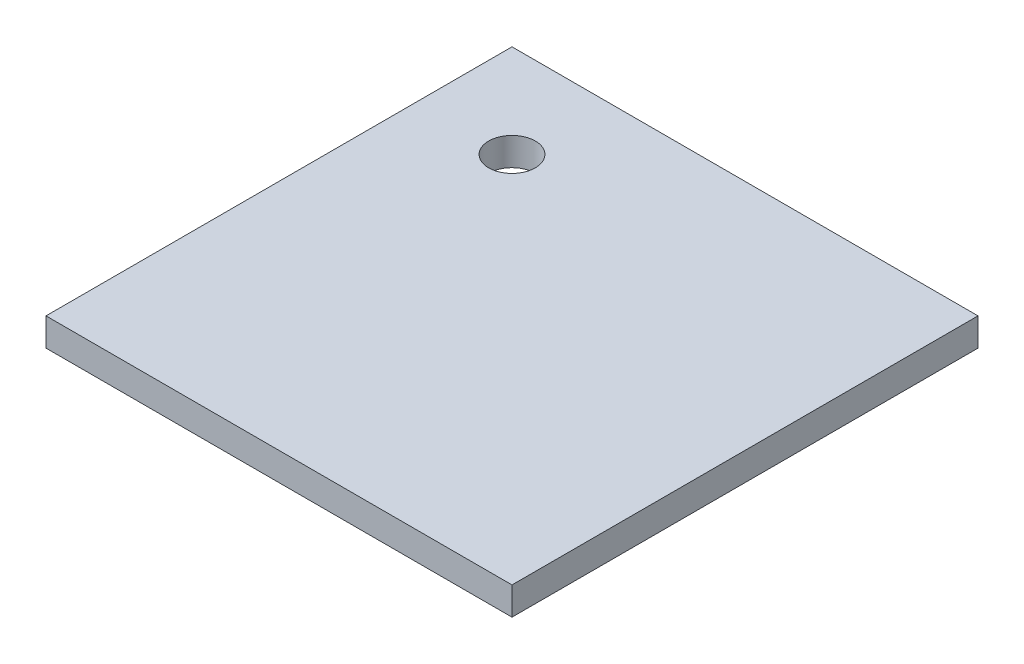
from build123d import *

# Parameters (mm, degrees)
SKETCH_1_W          = 1000
SKETCH_1_H          = 60
EXTRUDE_1_DEPTH     = 1000
SKETCH_2_R          = 50
CUT_EXTRUDE_2_DEPTH = 1416.485782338


with BuildPart() as part:
    # Sketch 1 → Extrude 1 (new body)
    with BuildSketch(Plane.XY):
        with Locations((500, 30)):
            Rectangle(SKETCH_1_W, SKETCH_1_H)
    extrude(amount=EXTRUDE_1_DEPTH)

    # Sketch 2 → Cut-Extrude 2 (cut, through all)
    with BuildSketch(Plane(origin=(0, 60, 0), x_dir=(1, 0, 0), z_dir=(0, 1, 0))):
        with Locations(Location((200, -200, 0), (0, 0, 270))):
            Circle(SKETCH_2_R)
    extrude(amount=-CUT_EXTRUDE_2_DEPTH, mode=Mode.SUBTRACT)


solid = part.part
